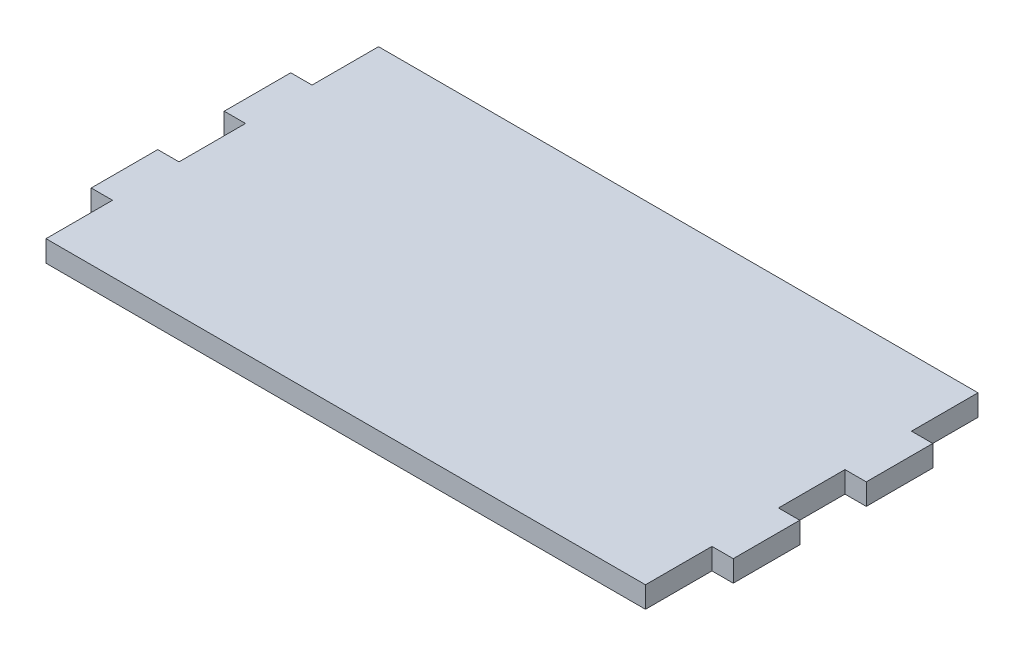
ISO-10303-21;
HEADER;
FILE_DESCRIPTION(('STEP AP214'),'2;1');
FILE_NAME('part.step','',(''),(''),'','','');
FILE_SCHEMA(('AUTOMOTIVE_DESIGN { 1 0 10303 214 1 1 1 1 }'));
ENDSEC;
DATA;
#1=APPLICATION_CONTEXT('core data for automotive mechanical design processes');
#2=APPLICATION_PROTOCOL_DEFINITION('international standard','automotive_design',2000,#1);
#3=PRODUCT_CONTEXT('',#1,'mechanical');
#4=PRODUCT('Part','Part','',(#3));
#5=PRODUCT_RELATED_PRODUCT_CATEGORY('part','',(#4));
#6=PRODUCT_DEFINITION_FORMATION('','',#4);
#7=PRODUCT_DEFINITION_CONTEXT('part definition',#1,'design');
#8=PRODUCT_DEFINITION('design','',#6,#7);
#9=PRODUCT_DEFINITION_SHAPE('','',#8);
#10=(LENGTH_UNIT() NAMED_UNIT(*) SI_UNIT(.MILLI.,.METRE.));
#11=(NAMED_UNIT(*) PLANE_ANGLE_UNIT() SI_UNIT($,.RADIAN.));
#12=(NAMED_UNIT(*) SI_UNIT($,.STERADIAN.) SOLID_ANGLE_UNIT());
#13=UNCERTAINTY_MEASURE_WITH_UNIT(LENGTH_MEASURE(1.E-05),#10,'distance_accuracy_value','');
#14=(GEOMETRIC_REPRESENTATION_CONTEXT(3) GLOBAL_UNCERTAINTY_ASSIGNED_CONTEXT((#13)) GLOBAL_UNIT_ASSIGNED_CONTEXT((#10,
#11,#12)) REPRESENTATION_CONTEXT('',''));
#15=CARTESIAN_POINT('',(0.,0.,0.));
#16=DIRECTION('',(0.,0.,1.));
#17=DIRECTION('',(1.,0.,0.));
#18=AXIS2_PLACEMENT_3D('',#15,#16,#17);
#19=CARTESIAN_POINT('',(169.,12.,-56.25));
#20=DIRECTION('',(-1.,0.,0.));
#21=DIRECTION('',(0.,0.,1.));
#22=AXIS2_PLACEMENT_3D('',#19,#20,#21);
#23=PLANE('',#22);
#24=DIRECTION('',(0.,0.,-1.));
#25=VECTOR('',#24,1.);
#26=CARTESIAN_POINT('',(169.,0.,-56.25));
#27=LINE('',#26,#25);
#28=CARTESIAN_POINT('',(169.,0.,-56.25));
#29=VERTEX_POINT('',#28);
#30=CARTESIAN_POINT('',(169.,0.,-93.75));
#31=VERTEX_POINT('',#30);
#32=EDGE_CURVE('E218',#29,#31,#27,.T.);
#33=ORIENTED_EDGE('',*,*,#32,.T.);
#34=DIRECTION('',(0.,-1.,0.));
#35=VECTOR('',#34,1.);
#36=CARTESIAN_POINT('',(169.,12.,-93.75));
#37=LINE('',#36,#35);
#38=CARTESIAN_POINT('',(169.,12.,-93.75));
#39=VERTEX_POINT('',#38);
#40=EDGE_CURVE('E11',#39,#31,#37,.T.);
#41=ORIENTED_EDGE('',*,*,#40,.F.);
#42=DIRECTION('',(0.,0.,-1.));
#43=VECTOR('',#42,1.);
#44=CARTESIAN_POINT('',(169.,12.,-56.25));
#45=LINE('',#44,#43);
#46=CARTESIAN_POINT('',(169.,12.,-56.25));
#47=VERTEX_POINT('',#46);
#48=EDGE_CURVE('E276',#47,#39,#45,.T.);
#49=ORIENTED_EDGE('',*,*,#48,.F.);
#50=DIRECTION('',(0.,-1.,0.));
#51=VECTOR('',#50,1.);
#52=CARTESIAN_POINT('',(169.,12.,-56.25));
#53=LINE('',#52,#51);
#54=EDGE_CURVE('E214',#47,#29,#53,.T.);
#55=ORIENTED_EDGE('',*,*,#54,.T.);
#56=EDGE_LOOP('',(#33,#41,#49,#55));
#57=FACE_BOUND('',#56,.T.);
#58=ADVANCED_FACE('F45',(#57),#23,.F.);
#59=CARTESIAN_POINT('',(-169.,12.,-93.75));
#60=DIRECTION('',(0.,0.,1.));
#61=DIRECTION('',(1.,0.,0.));
#62=AXIS2_PLACEMENT_3D('',#59,#60,#61);
#63=PLANE('',#62);
#64=DIRECTION('',(-1.,0.,0.));
#65=VECTOR('',#64,1.);
#66=CARTESIAN_POINT('',(-169.,0.,-93.75));
#67=LINE('',#66,#65);
#68=CARTESIAN_POINT('',(-169.,0.,-93.75));
#69=VERTEX_POINT('',#68);
#70=EDGE_CURVE('E222',#31,#69,#67,.T.);
#71=ORIENTED_EDGE('',*,*,#70,.T.);
#72=DIRECTION('',(0.,-1.,0.));
#73=VECTOR('',#72,1.);
#74=CARTESIAN_POINT('',(-169.,12.,-93.75));
#75=LINE('',#74,#73);
#76=CARTESIAN_POINT('',(-169.,12.,-93.75));
#77=VERTEX_POINT('',#76);
#78=EDGE_CURVE('E54',#77,#69,#75,.T.);
#79=ORIENTED_EDGE('',*,*,#78,.F.);
#80=DIRECTION('',(-1.,0.,0.));
#81=VECTOR('',#80,1.);
#82=CARTESIAN_POINT('',(-169.,12.,-93.75));
#83=LINE('',#82,#81);
#84=EDGE_CURVE('E141',#39,#77,#83,.T.);
#85=ORIENTED_EDGE('',*,*,#84,.F.);
#86=ORIENTED_EDGE('',*,*,#40,.T.);
#87=EDGE_LOOP('',(#71,#79,#85,#86));
#88=FACE_BOUND('',#87,.T.);
#89=ADVANCED_FACE('F426',(#88),#63,.F.);
#90=CARTESIAN_POINT('',(-169.,12.,-56.25));
#91=DIRECTION('',(1.,0.,0.));
#92=DIRECTION('',(0.,0.,-1.));
#93=AXIS2_PLACEMENT_3D('',#90,#91,#92);
#94=PLANE('',#93);
#95=DIRECTION('',(0.,0.,1.));
#96=VECTOR('',#95,1.);
#97=CARTESIAN_POINT('',(-169.,0.,-56.25));
#98=LINE('',#97,#96);
#99=CARTESIAN_POINT('',(-169.,0.,-56.25));
#100=VERTEX_POINT('',#99);
#101=EDGE_CURVE('E225',#69,#100,#98,.T.);
#102=ORIENTED_EDGE('',*,*,#101,.T.);
#103=DIRECTION('',(0.,-1.,0.));
#104=VECTOR('',#103,1.);
#105=CARTESIAN_POINT('',(-169.,12.,-56.25));
#106=LINE('',#105,#104);
#107=CARTESIAN_POINT('',(-169.,12.,-56.25));
#108=VERTEX_POINT('',#107);
#109=EDGE_CURVE('E335',#108,#100,#106,.T.);
#110=ORIENTED_EDGE('',*,*,#109,.F.);
#111=DIRECTION('',(0.,0.,1.));
#112=VECTOR('',#111,1.);
#113=CARTESIAN_POINT('',(-169.,12.,-56.25));
#114=LINE('',#113,#112);
#115=EDGE_CURVE('E345',#77,#108,#114,.T.);
#116=ORIENTED_EDGE('',*,*,#115,.F.);
#117=ORIENTED_EDGE('',*,*,#78,.T.);
#118=EDGE_LOOP('',(#102,#110,#116,#117));
#119=FACE_BOUND('',#118,.T.);
#120=ADVANCED_FACE('F343',(#119),#94,.F.);
#121=CARTESIAN_POINT('',(-169.,12.,-56.25));
#122=DIRECTION('',(0.,0.,1.));
#123=DIRECTION('',(1.,0.,0.));
#124=AXIS2_PLACEMENT_3D('',#121,#122,#123);
#125=PLANE('',#124);
#126=DIRECTION('',(-1.,0.,0.));
#127=VECTOR('',#126,1.);
#128=CARTESIAN_POINT('',(-169.,0.,-56.25));
#129=LINE('',#128,#127);
#130=CARTESIAN_POINT('',(-181.,0.,-56.25));
#131=VERTEX_POINT('',#130);
#132=EDGE_CURVE('E228',#100,#131,#129,.T.);
#133=ORIENTED_EDGE('',*,*,#132,.T.);
#134=DIRECTION('',(0.,-1.,0.));
#135=VECTOR('',#134,1.);
#136=CARTESIAN_POINT('',(-181.,12.,-56.25));
#137=LINE('',#136,#135);
#138=CARTESIAN_POINT('',(-181.,12.,-56.25));
#139=VERTEX_POINT('',#138);
#140=EDGE_CURVE('E331',#139,#131,#137,.T.);
#141=ORIENTED_EDGE('',*,*,#140,.F.);
#142=DIRECTION('',(-1.,0.,0.));
#143=VECTOR('',#142,1.);
#144=CARTESIAN_POINT('',(-169.,12.,-56.25));
#145=LINE('',#144,#143);
#146=EDGE_CURVE('E364',#108,#139,#145,.T.);
#147=ORIENTED_EDGE('',*,*,#146,.F.);
#148=ORIENTED_EDGE('',*,*,#109,.T.);
#149=EDGE_LOOP('',(#133,#141,#147,#148));
#150=FACE_BOUND('',#149,.T.);
#151=ADVANCED_FACE('F354',(#150),#125,.F.);
#152=CARTESIAN_POINT('',(-181.,12.,-18.75));
#153=DIRECTION('',(1.,0.,0.));
#154=DIRECTION('',(0.,0.,-1.));
#155=AXIS2_PLACEMENT_3D('',#152,#153,#154);
#156=PLANE('',#155);
#157=DIRECTION('',(0.,0.,1.));
#158=VECTOR('',#157,1.);
#159=CARTESIAN_POINT('',(-181.,0.,-18.75));
#160=LINE('',#159,#158);
#161=CARTESIAN_POINT('',(-181.,0.,-18.75));
#162=VERTEX_POINT('',#161);
#163=EDGE_CURVE('E231',#131,#162,#160,.T.);
#164=ORIENTED_EDGE('',*,*,#163,.T.);
#165=DIRECTION('',(0.,-1.,0.));
#166=VECTOR('',#165,1.);
#167=CARTESIAN_POINT('',(-181.,12.,-18.75));
#168=LINE('',#167,#166);
#169=CARTESIAN_POINT('',(-181.,12.,-18.75));
#170=VERTEX_POINT('',#169);
#171=EDGE_CURVE('E327',#170,#162,#168,.T.);
#172=ORIENTED_EDGE('',*,*,#171,.F.);
#173=DIRECTION('',(0.,0.,1.));
#174=VECTOR('',#173,1.);
#175=CARTESIAN_POINT('',(-181.,12.,-18.75));
#176=LINE('',#175,#174);
#177=EDGE_CURVE('E360',#139,#170,#176,.T.);
#178=ORIENTED_EDGE('',*,*,#177,.F.);
#179=ORIENTED_EDGE('',*,*,#140,.T.);
#180=EDGE_LOOP('',(#164,#172,#178,#179));
#181=FACE_BOUND('',#180,.T.);
#182=ADVANCED_FACE('F358',(#181),#156,.F.);
#183=CARTESIAN_POINT('',(-169.,12.,-18.75));
#184=DIRECTION('',(0.,0.,-1.));
#185=DIRECTION('',(-1.,0.,0.));
#186=AXIS2_PLACEMENT_3D('',#183,#184,#185);
#187=PLANE('',#186);
#188=DIRECTION('',(1.,0.,0.));
#189=VECTOR('',#188,1.);
#190=CARTESIAN_POINT('',(-169.,0.,-18.75));
#191=LINE('',#190,#189);
#192=CARTESIAN_POINT('',(-169.,0.,-18.75));
#193=VERTEX_POINT('',#192);
#194=EDGE_CURVE('E234',#162,#193,#191,.T.);
#195=ORIENTED_EDGE('',*,*,#194,.T.);
#196=DIRECTION('',(0.,-1.,0.));
#197=VECTOR('',#196,1.);
#198=CARTESIAN_POINT('',(-169.,12.,-18.75));
#199=LINE('',#198,#197);
#200=CARTESIAN_POINT('',(-169.,12.,-18.75));
#201=VERTEX_POINT('',#200);
#202=EDGE_CURVE('E323',#201,#193,#199,.T.);
#203=ORIENTED_EDGE('',*,*,#202,.F.);
#204=DIRECTION('',(1.,0.,0.));
#205=VECTOR('',#204,1.);
#206=CARTESIAN_POINT('',(-169.,12.,-18.75));
#207=LINE('',#206,#205);
#208=EDGE_CURVE('E363',#170,#201,#207,.T.);
#209=ORIENTED_EDGE('',*,*,#208,.F.);
#210=ORIENTED_EDGE('',*,*,#171,.T.);
#211=EDGE_LOOP('',(#195,#203,#209,#210));
#212=FACE_BOUND('',#211,.T.);
#213=ADVANCED_FACE('F439',(#212),#187,.F.);
#214=CARTESIAN_POINT('',(-169.,12.,18.75));
#215=DIRECTION('',(1.,0.,0.));
#216=DIRECTION('',(0.,0.,-1.));
#217=AXIS2_PLACEMENT_3D('',#214,#215,#216);
#218=PLANE('',#217);
#219=DIRECTION('',(0.,0.,1.));
#220=VECTOR('',#219,1.);
#221=CARTESIAN_POINT('',(-169.,0.,18.75));
#222=LINE('',#221,#220);
#223=CARTESIAN_POINT('',(-169.,0.,18.75));
#224=VERTEX_POINT('',#223);
#225=EDGE_CURVE('E237',#193,#224,#222,.T.);
#226=ORIENTED_EDGE('',*,*,#225,.T.);
#227=DIRECTION('',(0.,-1.,0.));
#228=VECTOR('',#227,1.);
#229=CARTESIAN_POINT('',(-169.,12.,18.75));
#230=LINE('',#229,#228);
#231=CARTESIAN_POINT('',(-169.,12.,18.75));
#232=VERTEX_POINT('',#231);
#233=EDGE_CURVE('E319',#232,#224,#230,.T.);
#234=ORIENTED_EDGE('',*,*,#233,.F.);
#235=DIRECTION('',(0.,0.,1.));
#236=VECTOR('',#235,1.);
#237=CARTESIAN_POINT('',(-169.,12.,18.75));
#238=LINE('',#237,#236);
#239=EDGE_CURVE('E368',#201,#232,#238,.T.);
#240=ORIENTED_EDGE('',*,*,#239,.F.);
#241=ORIENTED_EDGE('',*,*,#202,.T.);
#242=EDGE_LOOP('',(#226,#234,#240,#241));
#243=FACE_BOUND('',#242,.T.);
#244=ADVANCED_FACE('F442',(#243),#218,.F.);
#245=CARTESIAN_POINT('',(-169.,12.,18.75));
#246=DIRECTION('',(0.,0.,1.));
#247=DIRECTION('',(1.,0.,0.));
#248=AXIS2_PLACEMENT_3D('',#245,#246,#247);
#249=PLANE('',#248);
#250=DIRECTION('',(-1.,0.,0.));
#251=VECTOR('',#250,1.);
#252=CARTESIAN_POINT('',(-169.,0.,18.75));
#253=LINE('',#252,#251);
#254=CARTESIAN_POINT('',(-181.,0.,18.75));
#255=VERTEX_POINT('',#254);
#256=EDGE_CURVE('E240',#224,#255,#253,.T.);
#257=ORIENTED_EDGE('',*,*,#256,.T.);
#258=DIRECTION('',(0.,-1.,0.));
#259=VECTOR('',#258,1.);
#260=CARTESIAN_POINT('',(-181.,12.,18.75));
#261=LINE('',#260,#259);
#262=CARTESIAN_POINT('',(-181.,12.,18.75));
#263=VERTEX_POINT('',#262);
#264=EDGE_CURVE('E315',#263,#255,#261,.T.);
#265=ORIENTED_EDGE('',*,*,#264,.F.);
#266=DIRECTION('',(-1.,0.,0.));
#267=VECTOR('',#266,1.);
#268=CARTESIAN_POINT('',(-169.,12.,18.75));
#269=LINE('',#268,#267);
#270=EDGE_CURVE('E375',#232,#263,#269,.T.);
#271=ORIENTED_EDGE('',*,*,#270,.F.);
#272=ORIENTED_EDGE('',*,*,#233,.T.);
#273=EDGE_LOOP('',(#257,#265,#271,#272));
#274=FACE_BOUND('',#273,.T.);
#275=ADVANCED_FACE('F446',(#274),#249,.F.);
#276=CARTESIAN_POINT('',(-181.,12.,56.25));
#277=DIRECTION('',(1.,0.,0.));
#278=DIRECTION('',(0.,0.,-1.));
#279=AXIS2_PLACEMENT_3D('',#276,#277,#278);
#280=PLANE('',#279);
#281=DIRECTION('',(0.,0.,1.));
#282=VECTOR('',#281,1.);
#283=CARTESIAN_POINT('',(-181.,0.,56.25));
#284=LINE('',#283,#282);
#285=CARTESIAN_POINT('',(-181.,0.,56.25));
#286=VERTEX_POINT('',#285);
#287=EDGE_CURVE('E243',#255,#286,#284,.T.);
#288=ORIENTED_EDGE('',*,*,#287,.T.);
#289=DIRECTION('',(0.,-1.,0.));
#290=VECTOR('',#289,1.);
#291=CARTESIAN_POINT('',(-181.,12.,56.25));
#292=LINE('',#291,#290);
#293=CARTESIAN_POINT('',(-181.,12.,56.25));
#294=VERTEX_POINT('',#293);
#295=EDGE_CURVE('E311',#294,#286,#292,.T.);
#296=ORIENTED_EDGE('',*,*,#295,.F.);
#297=DIRECTION('',(0.,0.,1.));
#298=VECTOR('',#297,1.);
#299=CARTESIAN_POINT('',(-181.,12.,56.25));
#300=LINE('',#299,#298);
#301=EDGE_CURVE('E378',#263,#294,#300,.T.);
#302=ORIENTED_EDGE('',*,*,#301,.F.);
#303=ORIENTED_EDGE('',*,*,#264,.T.);
#304=EDGE_LOOP('',(#288,#296,#302,#303));
#305=FACE_BOUND('',#304,.T.);
#306=ADVANCED_FACE('F450',(#305),#280,.F.);
#307=CARTESIAN_POINT('',(-169.,12.,56.25));
#308=DIRECTION('',(0.,0.,-1.));
#309=DIRECTION('',(-1.,0.,0.));
#310=AXIS2_PLACEMENT_3D('',#307,#308,#309);
#311=PLANE('',#310);
#312=DIRECTION('',(1.,0.,0.));
#313=VECTOR('',#312,1.);
#314=CARTESIAN_POINT('',(-169.,0.,56.25));
#315=LINE('',#314,#313);
#316=CARTESIAN_POINT('',(-169.,0.,56.25));
#317=VERTEX_POINT('',#316);
#318=EDGE_CURVE('E246',#286,#317,#315,.T.);
#319=ORIENTED_EDGE('',*,*,#318,.T.);
#320=DIRECTION('',(0.,-1.,0.));
#321=VECTOR('',#320,1.);
#322=CARTESIAN_POINT('',(-169.,12.,56.25));
#323=LINE('',#322,#321);
#324=CARTESIAN_POINT('',(-169.,12.,56.25));
#325=VERTEX_POINT('',#324);
#326=EDGE_CURVE('E307',#325,#317,#323,.T.);
#327=ORIENTED_EDGE('',*,*,#326,.F.);
#328=DIRECTION('',(1.,0.,0.));
#329=VECTOR('',#328,1.);
#330=CARTESIAN_POINT('',(-169.,12.,56.25));
#331=LINE('',#330,#329);
#332=EDGE_CURVE('E381',#294,#325,#331,.T.);
#333=ORIENTED_EDGE('',*,*,#332,.F.);
#334=ORIENTED_EDGE('',*,*,#295,.T.);
#335=EDGE_LOOP('',(#319,#327,#333,#334));
#336=FACE_BOUND('',#335,.T.);
#337=ADVANCED_FACE('F454',(#336),#311,.F.);
#338=CARTESIAN_POINT('',(-169.,12.,93.75));
#339=DIRECTION('',(1.,0.,0.));
#340=DIRECTION('',(0.,0.,-1.));
#341=AXIS2_PLACEMENT_3D('',#338,#339,#340);
#342=PLANE('',#341);
#343=DIRECTION('',(0.,0.,1.));
#344=VECTOR('',#343,1.);
#345=CARTESIAN_POINT('',(-169.,0.,93.75));
#346=LINE('',#345,#344);
#347=CARTESIAN_POINT('',(-169.,0.,93.75));
#348=VERTEX_POINT('',#347);
#349=EDGE_CURVE('E249',#317,#348,#346,.T.);
#350=ORIENTED_EDGE('',*,*,#349,.T.);
#351=DIRECTION('',(0.,-1.,0.));
#352=VECTOR('',#351,1.);
#353=CARTESIAN_POINT('',(-169.,12.,93.75));
#354=LINE('',#353,#352);
#355=CARTESIAN_POINT('',(-169.,12.,93.75));
#356=VERTEX_POINT('',#355);
#357=EDGE_CURVE('E303',#356,#348,#354,.T.);
#358=ORIENTED_EDGE('',*,*,#357,.F.);
#359=DIRECTION('',(0.,0.,1.));
#360=VECTOR('',#359,1.);
#361=CARTESIAN_POINT('',(-169.,12.,93.75));
#362=LINE('',#361,#360);
#363=EDGE_CURVE('E384',#325,#356,#362,.T.);
#364=ORIENTED_EDGE('',*,*,#363,.F.);
#365=ORIENTED_EDGE('',*,*,#326,.T.);
#366=EDGE_LOOP('',(#350,#358,#364,#365));
#367=FACE_BOUND('',#366,.T.);
#368=ADVANCED_FACE('F458',(#367),#342,.F.);
#369=CARTESIAN_POINT('',(-169.,12.,93.75));
#370=DIRECTION('',(0.,0.,-1.));
#371=DIRECTION('',(-1.,0.,0.));
#372=AXIS2_PLACEMENT_3D('',#369,#370,#371);
#373=PLANE('',#372);
#374=DIRECTION('',(1.,0.,0.));
#375=VECTOR('',#374,1.);
#376=CARTESIAN_POINT('',(-169.,0.,93.75));
#377=LINE('',#376,#375);
#378=CARTESIAN_POINT('',(169.,0.,93.75));
#379=VERTEX_POINT('',#378);
#380=EDGE_CURVE('E252',#348,#379,#377,.T.);
#381=ORIENTED_EDGE('',*,*,#380,.T.);
#382=DIRECTION('',(0.,-1.,0.));
#383=VECTOR('',#382,1.);
#384=CARTESIAN_POINT('',(169.,12.,93.75));
#385=LINE('',#384,#383);
#386=CARTESIAN_POINT('',(169.,12.,93.75));
#387=VERTEX_POINT('',#386);
#388=EDGE_CURVE('E299',#387,#379,#385,.T.);
#389=ORIENTED_EDGE('',*,*,#388,.F.);
#390=DIRECTION('',(1.,0.,0.));
#391=VECTOR('',#390,1.);
#392=CARTESIAN_POINT('',(-169.,12.,93.75));
#393=LINE('',#392,#391);
#394=EDGE_CURVE('E387',#356,#387,#393,.T.);
#395=ORIENTED_EDGE('',*,*,#394,.F.);
#396=ORIENTED_EDGE('',*,*,#357,.T.);
#397=EDGE_LOOP('',(#381,#389,#395,#396));
#398=FACE_BOUND('',#397,.T.);
#399=ADVANCED_FACE('F462',(#398),#373,.F.);
#400=CARTESIAN_POINT('',(169.,12.,93.75));
#401=DIRECTION('',(-1.,0.,0.));
#402=DIRECTION('',(0.,0.,1.));
#403=AXIS2_PLACEMENT_3D('',#400,#401,#402);
#404=PLANE('',#403);
#405=DIRECTION('',(0.,0.,-1.));
#406=VECTOR('',#405,1.);
#407=CARTESIAN_POINT('',(169.,0.,93.75));
#408=LINE('',#407,#406);
#409=CARTESIAN_POINT('',(169.,0.,56.25));
#410=VERTEX_POINT('',#409);
#411=EDGE_CURVE('E255',#379,#410,#408,.T.);
#412=ORIENTED_EDGE('',*,*,#411,.T.);
#413=DIRECTION('',(0.,-1.,0.));
#414=VECTOR('',#413,1.);
#415=CARTESIAN_POINT('',(169.,12.,56.25));
#416=LINE('',#415,#414);
#417=CARTESIAN_POINT('',(169.,12.,56.25));
#418=VERTEX_POINT('',#417);
#419=EDGE_CURVE('E295',#418,#410,#416,.T.);
#420=ORIENTED_EDGE('',*,*,#419,.F.);
#421=DIRECTION('',(0.,0.,-1.));
#422=VECTOR('',#421,1.);
#423=CARTESIAN_POINT('',(169.,12.,93.75));
#424=LINE('',#423,#422);
#425=EDGE_CURVE('E390',#387,#418,#424,.T.);
#426=ORIENTED_EDGE('',*,*,#425,.F.);
#427=ORIENTED_EDGE('',*,*,#388,.T.);
#428=EDGE_LOOP('',(#412,#420,#426,#427));
#429=FACE_BOUND('',#428,.T.);
#430=ADVANCED_FACE('F466',(#429),#404,.F.);
#431=CARTESIAN_POINT('',(169.,12.,56.25));
#432=DIRECTION('',(0.,0.,-1.));
#433=DIRECTION('',(-1.,0.,0.));
#434=AXIS2_PLACEMENT_3D('',#431,#432,#433);
#435=PLANE('',#434);
#436=DIRECTION('',(1.,0.,0.));
#437=VECTOR('',#436,1.);
#438=CARTESIAN_POINT('',(169.,0.,56.25));
#439=LINE('',#438,#437);
#440=CARTESIAN_POINT('',(181.,0.,56.25));
#441=VERTEX_POINT('',#440);
#442=EDGE_CURVE('E258',#410,#441,#439,.T.);
#443=ORIENTED_EDGE('',*,*,#442,.T.);
#444=DIRECTION('',(0.,-1.,0.));
#445=VECTOR('',#444,1.);
#446=CARTESIAN_POINT('',(181.,12.,56.25));
#447=LINE('',#446,#445);
#448=CARTESIAN_POINT('',(181.,12.,56.25));
#449=VERTEX_POINT('',#448);
#450=EDGE_CURVE('E291',#449,#441,#447,.T.);
#451=ORIENTED_EDGE('',*,*,#450,.F.);
#452=DIRECTION('',(1.,0.,0.));
#453=VECTOR('',#452,1.);
#454=CARTESIAN_POINT('',(169.,12.,56.25));
#455=LINE('',#454,#453);
#456=EDGE_CURVE('E393',#418,#449,#455,.T.);
#457=ORIENTED_EDGE('',*,*,#456,.F.);
#458=ORIENTED_EDGE('',*,*,#419,.T.);
#459=EDGE_LOOP('',(#443,#451,#457,#458));
#460=FACE_BOUND('',#459,.T.);
#461=ADVANCED_FACE('F470',(#460),#435,.F.);
#462=CARTESIAN_POINT('',(181.,12.,56.25));
#463=DIRECTION('',(-1.,0.,0.));
#464=DIRECTION('',(0.,0.,1.));
#465=AXIS2_PLACEMENT_3D('',#462,#463,#464);
#466=PLANE('',#465);
#467=DIRECTION('',(0.,0.,-1.));
#468=VECTOR('',#467,1.);
#469=CARTESIAN_POINT('',(181.,0.,56.25));
#470=LINE('',#469,#468);
#471=CARTESIAN_POINT('',(181.,0.,18.75));
#472=VERTEX_POINT('',#471);
#473=EDGE_CURVE('E261',#441,#472,#470,.T.);
#474=ORIENTED_EDGE('',*,*,#473,.T.);
#475=DIRECTION('',(0.,-1.,0.));
#476=VECTOR('',#475,1.);
#477=CARTESIAN_POINT('',(181.,12.,18.75));
#478=LINE('',#477,#476);
#479=CARTESIAN_POINT('',(181.,12.,18.75));
#480=VERTEX_POINT('',#479);
#481=EDGE_CURVE('E287',#480,#472,#478,.T.);
#482=ORIENTED_EDGE('',*,*,#481,.F.);
#483=DIRECTION('',(0.,0.,-1.));
#484=VECTOR('',#483,1.);
#485=CARTESIAN_POINT('',(181.,12.,56.25));
#486=LINE('',#485,#484);
#487=EDGE_CURVE('E396',#449,#480,#486,.T.);
#488=ORIENTED_EDGE('',*,*,#487,.F.);
#489=ORIENTED_EDGE('',*,*,#450,.T.);
#490=EDGE_LOOP('',(#474,#482,#488,#489));
#491=FACE_BOUND('',#490,.T.);
#492=ADVANCED_FACE('F474',(#491),#466,.F.);
#493=CARTESIAN_POINT('',(169.,12.,18.75));
#494=DIRECTION('',(0.,0.,1.));
#495=DIRECTION('',(1.,0.,0.));
#496=AXIS2_PLACEMENT_3D('',#493,#494,#495);
#497=PLANE('',#496);
#498=DIRECTION('',(-1.,0.,0.));
#499=VECTOR('',#498,1.);
#500=CARTESIAN_POINT('',(169.,0.,18.75));
#501=LINE('',#500,#499);
#502=CARTESIAN_POINT('',(169.,0.,18.75));
#503=VERTEX_POINT('',#502);
#504=EDGE_CURVE('E264',#472,#503,#501,.T.);
#505=ORIENTED_EDGE('',*,*,#504,.T.);
#506=DIRECTION('',(0.,-1.,0.));
#507=VECTOR('',#506,1.);
#508=CARTESIAN_POINT('',(169.,12.,18.75));
#509=LINE('',#508,#507);
#510=CARTESIAN_POINT('',(169.,12.,18.75));
#511=VERTEX_POINT('',#510);
#512=EDGE_CURVE('E283',#511,#503,#509,.T.);
#513=ORIENTED_EDGE('',*,*,#512,.F.);
#514=DIRECTION('',(-1.,0.,0.));
#515=VECTOR('',#514,1.);
#516=CARTESIAN_POINT('',(169.,12.,18.75));
#517=LINE('',#516,#515);
#518=EDGE_CURVE('E399',#480,#511,#517,.T.);
#519=ORIENTED_EDGE('',*,*,#518,.F.);
#520=ORIENTED_EDGE('',*,*,#481,.T.);
#521=EDGE_LOOP('',(#505,#513,#519,#520));
#522=FACE_BOUND('',#521,.T.);
#523=ADVANCED_FACE('F407',(#522),#497,.F.);
#524=CARTESIAN_POINT('',(169.,12.,18.75));
#525=DIRECTION('',(-1.,0.,0.));
#526=DIRECTION('',(0.,0.,1.));
#527=AXIS2_PLACEMENT_3D('',#524,#525,#526);
#528=PLANE('',#527);
#529=DIRECTION('',(0.,0.,-1.));
#530=VECTOR('',#529,1.);
#531=CARTESIAN_POINT('',(169.,0.,18.75));
#532=LINE('',#531,#530);
#533=CARTESIAN_POINT('',(169.,0.,-18.75));
#534=VERTEX_POINT('',#533);
#535=EDGE_CURVE('E267',#503,#534,#532,.T.);
#536=ORIENTED_EDGE('',*,*,#535,.T.);
#537=DIRECTION('',(0.,-1.,0.));
#538=VECTOR('',#537,1.);
#539=CARTESIAN_POINT('',(169.,12.,-18.75));
#540=LINE('',#539,#538);
#541=CARTESIAN_POINT('',(169.,12.,-18.75));
#542=VERTEX_POINT('',#541);
#543=EDGE_CURVE('E207',#542,#534,#540,.T.);
#544=ORIENTED_EDGE('',*,*,#543,.F.);
#545=DIRECTION('',(0.,0.,-1.));
#546=VECTOR('',#545,1.);
#547=CARTESIAN_POINT('',(169.,12.,18.75));
#548=LINE('',#547,#546);
#549=EDGE_CURVE('E196',#511,#542,#548,.T.);
#550=ORIENTED_EDGE('',*,*,#549,.F.);
#551=ORIENTED_EDGE('',*,*,#512,.T.);
#552=EDGE_LOOP('',(#536,#544,#550,#551));
#553=FACE_BOUND('',#552,.T.);
#554=ADVANCED_FACE('F411',(#553),#528,.F.);
#555=CARTESIAN_POINT('',(169.,12.,-18.75));
#556=DIRECTION('',(0.,0.,-1.));
#557=DIRECTION('',(-1.,0.,0.));
#558=AXIS2_PLACEMENT_3D('',#555,#556,#557);
#559=PLANE('',#558);
#560=DIRECTION('',(1.,0.,0.));
#561=VECTOR('',#560,1.);
#562=CARTESIAN_POINT('',(169.,0.,-18.75));
#563=LINE('',#562,#561);
#564=CARTESIAN_POINT('',(181.,0.,-18.75));
#565=VERTEX_POINT('',#564);
#566=EDGE_CURVE('E205',#534,#565,#563,.T.);
#567=ORIENTED_EDGE('',*,*,#566,.T.);
#568=DIRECTION('',(0.,-1.,0.));
#569=VECTOR('',#568,1.);
#570=CARTESIAN_POINT('',(181.,12.,-18.75));
#571=LINE('',#570,#569);
#572=CARTESIAN_POINT('',(181.,12.,-18.75));
#573=VERTEX_POINT('',#572);
#574=EDGE_CURVE('E202',#573,#565,#571,.T.);
#575=ORIENTED_EDGE('',*,*,#574,.F.);
#576=DIRECTION('',(1.,0.,0.));
#577=VECTOR('',#576,1.);
#578=CARTESIAN_POINT('',(169.,12.,-18.75));
#579=LINE('',#578,#577);
#580=EDGE_CURVE('E190',#542,#573,#579,.T.);
#581=ORIENTED_EDGE('',*,*,#580,.F.);
#582=ORIENTED_EDGE('',*,*,#543,.T.);
#583=EDGE_LOOP('',(#567,#575,#581,#582));
#584=FACE_BOUND('',#583,.T.);
#585=ADVANCED_FACE('F203',(#584),#559,.F.);
#586=CARTESIAN_POINT('',(181.,12.,-18.75));
#587=DIRECTION('',(-1.,0.,0.));
#588=DIRECTION('',(0.,0.,1.));
#589=AXIS2_PLACEMENT_3D('',#586,#587,#588);
#590=PLANE('',#589);
#591=DIRECTION('',(0.,0.,-1.));
#592=VECTOR('',#591,1.);
#593=CARTESIAN_POINT('',(181.,0.,-18.75));
#594=LINE('',#593,#592);
#595=CARTESIAN_POINT('',(181.,0.,-56.25));
#596=VERTEX_POINT('',#595);
#597=EDGE_CURVE('E127',#565,#596,#594,.T.);
#598=ORIENTED_EDGE('',*,*,#597,.T.);
#599=DIRECTION('',(0.,-1.,0.));
#600=VECTOR('',#599,1.);
#601=CARTESIAN_POINT('',(181.,12.,-56.25));
#602=LINE('',#601,#600);
#603=CARTESIAN_POINT('',(181.,12.,-56.25));
#604=VERTEX_POINT('',#603);
#605=EDGE_CURVE('E208',#604,#596,#602,.T.);
#606=ORIENTED_EDGE('',*,*,#605,.F.);
#607=DIRECTION('',(0.,0.,-1.));
#608=VECTOR('',#607,1.);
#609=CARTESIAN_POINT('',(181.,12.,-18.75));
#610=LINE('',#609,#608);
#611=EDGE_CURVE('E194',#573,#604,#610,.T.);
#612=ORIENTED_EDGE('',*,*,#611,.F.);
#613=ORIENTED_EDGE('',*,*,#574,.T.);
#614=EDGE_LOOP('',(#598,#606,#612,#613));
#615=FACE_BOUND('',#614,.T.);
#616=ADVANCED_FACE('F210',(#615),#590,.F.);
#617=CARTESIAN_POINT('',(169.,12.,-56.25));
#618=DIRECTION('',(0.,0.,1.));
#619=DIRECTION('',(1.,0.,0.));
#620=AXIS2_PLACEMENT_3D('',#617,#618,#619);
#621=PLANE('',#620);
#622=DIRECTION('',(-1.,0.,0.));
#623=VECTOR('',#622,1.);
#624=CARTESIAN_POINT('',(169.,0.,-56.25));
#625=LINE('',#624,#623);
#626=EDGE_CURVE('E133',#596,#29,#625,.T.);
#627=ORIENTED_EDGE('',*,*,#626,.T.);
#628=ORIENTED_EDGE('',*,*,#54,.F.);
#629=DIRECTION('',(-1.,0.,0.));
#630=VECTOR('',#629,1.);
#631=CARTESIAN_POINT('',(169.,12.,-56.25));
#632=LINE('',#631,#630);
#633=EDGE_CURVE('E62',#604,#47,#632,.T.);
#634=ORIENTED_EDGE('',*,*,#633,.F.);
#635=ORIENTED_EDGE('',*,*,#605,.T.);
#636=EDGE_LOOP('',(#627,#628,#634,#635));
#637=FACE_BOUND('',#636,.T.);
#638=ADVANCED_FACE('F415',(#637),#621,.F.);
#639=CARTESIAN_POINT('',(0.,12.,0.));
#640=DIRECTION('',(0.,-1.,0.));
#641=DIRECTION('',(0.,0.,-1.));
#642=AXIS2_PLACEMENT_3D('',#639,#640,#641);
#643=PLANE('',#642);
#644=ORIENTED_EDGE('',*,*,#48,.T.);
#645=ORIENTED_EDGE('',*,*,#84,.T.);
#646=ORIENTED_EDGE('',*,*,#115,.T.);
#647=ORIENTED_EDGE('',*,*,#146,.T.);
#648=ORIENTED_EDGE('',*,*,#177,.T.);
#649=ORIENTED_EDGE('',*,*,#208,.T.);
#650=ORIENTED_EDGE('',*,*,#239,.T.);
#651=ORIENTED_EDGE('',*,*,#270,.T.);
#652=ORIENTED_EDGE('',*,*,#301,.T.);
#653=ORIENTED_EDGE('',*,*,#332,.T.);
#654=ORIENTED_EDGE('',*,*,#363,.T.);
#655=ORIENTED_EDGE('',*,*,#394,.T.);
#656=ORIENTED_EDGE('',*,*,#425,.T.);
#657=ORIENTED_EDGE('',*,*,#456,.T.);
#658=ORIENTED_EDGE('',*,*,#487,.T.);
#659=ORIENTED_EDGE('',*,*,#518,.T.);
#660=ORIENTED_EDGE('',*,*,#549,.T.);
#661=ORIENTED_EDGE('',*,*,#580,.T.);
#662=ORIENTED_EDGE('',*,*,#611,.T.);
#663=ORIENTED_EDGE('',*,*,#633,.T.);
#664=EDGE_LOOP('',(#644,#645,#646,#647,#648,#649,#650,#651,#652,#653,#654,#655,#656,#657,#658,
#659,#660,#661,#662,#663));
#665=FACE_BOUND('',#664,.T.);
#666=ADVANCED_FACE('F192',(#665),#643,.F.);
#667=CARTESIAN_POINT('',(0.,0.,0.));
#668=DIRECTION('',(0.,-1.,0.));
#669=DIRECTION('',(0.,0.,-1.));
#670=AXIS2_PLACEMENT_3D('',#667,#668,#669);
#671=PLANE('',#670);
#672=ORIENTED_EDGE('',*,*,#32,.F.);
#673=ORIENTED_EDGE('',*,*,#626,.F.);
#674=ORIENTED_EDGE('',*,*,#597,.F.);
#675=ORIENTED_EDGE('',*,*,#566,.F.);
#676=ORIENTED_EDGE('',*,*,#535,.F.);
#677=ORIENTED_EDGE('',*,*,#504,.F.);
#678=ORIENTED_EDGE('',*,*,#473,.F.);
#679=ORIENTED_EDGE('',*,*,#442,.F.);
#680=ORIENTED_EDGE('',*,*,#411,.F.);
#681=ORIENTED_EDGE('',*,*,#380,.F.);
#682=ORIENTED_EDGE('',*,*,#349,.F.);
#683=ORIENTED_EDGE('',*,*,#318,.F.);
#684=ORIENTED_EDGE('',*,*,#287,.F.);
#685=ORIENTED_EDGE('',*,*,#256,.F.);
#686=ORIENTED_EDGE('',*,*,#225,.F.);
#687=ORIENTED_EDGE('',*,*,#194,.F.);
#688=ORIENTED_EDGE('',*,*,#163,.F.);
#689=ORIENTED_EDGE('',*,*,#132,.F.);
#690=ORIENTED_EDGE('',*,*,#101,.F.);
#691=ORIENTED_EDGE('',*,*,#70,.F.);
#692=EDGE_LOOP('',(#672,#673,#674,#675,#676,#677,#678,#679,#680,#681,#682,#683,#684,#685,#686,
#687,#688,#689,#690,#691));
#693=FACE_BOUND('',#692,.T.);
#694=ADVANCED_FACE('F349',(#693),#671,.T.);
#695=CLOSED_SHELL('',(#58,#89,#120,#151,#182,#213,#244,#275,#306,#337,#368,#399,#430,#461,#492,
#523,#554,#585,#616,#638,#666,#694));
#696=MANIFOLD_SOLID_BREP('B2',#695);
#697=ADVANCED_BREP_SHAPE_REPRESENTATION('',(#18,#696),#14);
#698=SHAPE_DEFINITION_REPRESENTATION(#9,#697);
ENDSEC;
END-ISO-10303-21;
